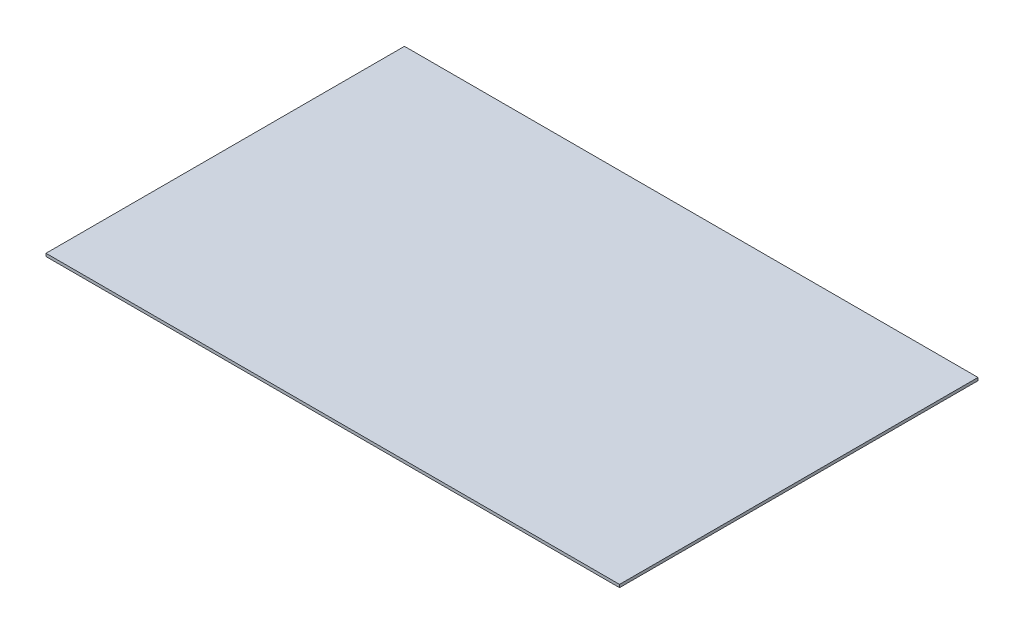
ISO-10303-21;
HEADER;
FILE_DESCRIPTION(('STEP AP214'),'2;1');
FILE_NAME('part.step','',(''),(''),'','','');
FILE_SCHEMA(('AUTOMOTIVE_DESIGN { 1 0 10303 214 1 1 1 1 }'));
ENDSEC;
DATA;
#1=APPLICATION_CONTEXT('core data for automotive mechanical design processes');
#2=APPLICATION_PROTOCOL_DEFINITION('international standard','automotive_design',2000,#1);
#3=PRODUCT_CONTEXT('',#1,'mechanical');
#4=PRODUCT('Part','Part','',(#3));
#5=PRODUCT_RELATED_PRODUCT_CATEGORY('part','',(#4));
#6=PRODUCT_DEFINITION_FORMATION('','',#4);
#7=PRODUCT_DEFINITION_CONTEXT('part definition',#1,'design');
#8=PRODUCT_DEFINITION('design','',#6,#7);
#9=PRODUCT_DEFINITION_SHAPE('','',#8);
#10=(LENGTH_UNIT() NAMED_UNIT(*) SI_UNIT(.MILLI.,.METRE.));
#11=(NAMED_UNIT(*) PLANE_ANGLE_UNIT() SI_UNIT($,.RADIAN.));
#12=(NAMED_UNIT(*) SI_UNIT($,.STERADIAN.) SOLID_ANGLE_UNIT());
#13=UNCERTAINTY_MEASURE_WITH_UNIT(LENGTH_MEASURE(1.E-05),#10,'distance_accuracy_value','');
#14=(GEOMETRIC_REPRESENTATION_CONTEXT(3) GLOBAL_UNCERTAINTY_ASSIGNED_CONTEXT((#13)) GLOBAL_UNIT_ASSIGNED_CONTEXT((#10,
#11,#12)) REPRESENTATION_CONTEXT('',''));
#15=CARTESIAN_POINT('',(0.,0.,0.));
#16=DIRECTION('',(0.,0.,1.));
#17=DIRECTION('',(1.,0.,0.));
#18=AXIS2_PLACEMENT_3D('',#15,#16,#17);
#19=CARTESIAN_POINT('',(-25.4,2.54,0.));
#20=DIRECTION('',(-1.,0.,0.));
#21=DIRECTION('',(0.,0.,1.));
#22=AXIS2_PLACEMENT_3D('',#19,#20,#21);
#23=PLANE('',#22);
#24=DIRECTION('',(0.,1.,0.));
#25=VECTOR('',#24,1.);
#26=CARTESIAN_POINT('',(-25.4,2.54,-57.15));
#27=LINE('',#26,#25);
#28=CARTESIAN_POINT('',(-25.4,2.413,-57.15));
#29=VERTEX_POINT('',#28);
#30=CARTESIAN_POINT('',(-25.4,2.667,-57.15));
#31=VERTEX_POINT('',#30);
#32=EDGE_CURVE('E11',#29,#31,#27,.T.);
#33=ORIENTED_EDGE('',*,*,#32,.F.);
#34=DIRECTION('',(0.,0.,1.));
#35=VECTOR('',#34,1.);
#36=CARTESIAN_POINT('',(-25.4,2.413,0.));
#37=LINE('',#36,#35);
#38=CARTESIAN_POINT('',(-25.4,2.413,-25.4));
#39=VERTEX_POINT('',#38);
#40=EDGE_CURVE('E94',#29,#39,#37,.T.);
#41=ORIENTED_EDGE('',*,*,#40,.T.);
#42=DIRECTION('',(0.,1.,0.));
#43=VECTOR('',#42,1.);
#44=CARTESIAN_POINT('',(-25.4,2.54,-25.4));
#45=LINE('',#44,#43);
#46=CARTESIAN_POINT('',(-25.4,2.667,-25.4));
#47=VERTEX_POINT('',#46);
#48=EDGE_CURVE('E49',#39,#47,#45,.T.);
#49=ORIENTED_EDGE('',*,*,#48,.T.);
#50=DIRECTION('',(0.,0.,1.));
#51=VECTOR('',#50,1.);
#52=CARTESIAN_POINT('',(-25.4,2.667,0.));
#53=LINE('',#52,#51);
#54=EDGE_CURVE('E107',#31,#47,#53,.T.);
#55=ORIENTED_EDGE('',*,*,#54,.F.);
#56=EDGE_LOOP('',(#33,#41,#49,#55));
#57=FACE_BOUND('',#56,.T.);
#58=ADVANCED_FACE('F39',(#57),#23,.T.);
#59=CARTESIAN_POINT('',(0.,2.54,-25.4));
#60=DIRECTION('',(0.,0.,1.));
#61=DIRECTION('',(1.,0.,0.));
#62=AXIS2_PLACEMENT_3D('',#59,#60,#61);
#63=PLANE('',#62);
#64=ORIENTED_EDGE('',*,*,#48,.F.);
#65=DIRECTION('',(1.,0.,0.));
#66=VECTOR('',#65,1.);
#67=CARTESIAN_POINT('',(0.,2.413,-25.4));
#68=LINE('',#67,#66);
#69=CARTESIAN_POINT('',(25.4,2.413,-25.4));
#70=VERTEX_POINT('',#69);
#71=EDGE_CURVE('E101',#39,#70,#68,.T.);
#72=ORIENTED_EDGE('',*,*,#71,.T.);
#73=DIRECTION('',(0.,1.,0.));
#74=VECTOR('',#73,1.);
#75=CARTESIAN_POINT('',(25.4,2.54,-25.4));
#76=LINE('',#75,#74);
#77=CARTESIAN_POINT('',(25.4,2.667,-25.4));
#78=VERTEX_POINT('',#77);
#79=EDGE_CURVE('E57',#70,#78,#76,.T.);
#80=ORIENTED_EDGE('',*,*,#79,.T.);
#81=DIRECTION('',(1.,0.,0.));
#82=VECTOR('',#81,1.);
#83=CARTESIAN_POINT('',(0.,2.667,-25.4));
#84=LINE('',#83,#82);
#85=EDGE_CURVE('E88',#47,#78,#84,.T.);
#86=ORIENTED_EDGE('',*,*,#85,.F.);
#87=EDGE_LOOP('',(#64,#72,#80,#86));
#88=FACE_BOUND('',#87,.T.);
#89=ADVANCED_FACE('F111',(#88),#63,.T.);
#90=CARTESIAN_POINT('',(25.4,2.54,0.));
#91=DIRECTION('',(-1.,0.,0.));
#92=DIRECTION('',(0.,0.,1.));
#93=AXIS2_PLACEMENT_3D('',#90,#91,#92);
#94=PLANE('',#93);
#95=ORIENTED_EDGE('',*,*,#79,.F.);
#96=DIRECTION('',(0.,0.,1.));
#97=VECTOR('',#96,1.);
#98=CARTESIAN_POINT('',(25.4,2.413,0.));
#99=LINE('',#98,#97);
#100=CARTESIAN_POINT('',(25.4,2.413,-57.15));
#101=VERTEX_POINT('',#100);
#102=EDGE_CURVE('E93',#70,#101,#99,.F.);
#103=ORIENTED_EDGE('',*,*,#102,.T.);
#104=DIRECTION('',(0.,1.,0.));
#105=VECTOR('',#104,1.);
#106=CARTESIAN_POINT('',(25.4,2.54,-57.15));
#107=LINE('',#106,#105);
#108=CARTESIAN_POINT('',(25.4,2.667,-57.15));
#109=VERTEX_POINT('',#108);
#110=EDGE_CURVE('E43',#101,#109,#107,.T.);
#111=ORIENTED_EDGE('',*,*,#110,.T.);
#112=DIRECTION('',(0.,0.,1.));
#113=VECTOR('',#112,1.);
#114=CARTESIAN_POINT('',(25.4,2.667,0.));
#115=LINE('',#114,#113);
#116=EDGE_CURVE('E103',#78,#109,#115,.F.);
#117=ORIENTED_EDGE('',*,*,#116,.F.);
#118=EDGE_LOOP('',(#95,#103,#111,#117));
#119=FACE_BOUND('',#118,.T.);
#120=ADVANCED_FACE('F96',(#119),#94,.F.);
#121=CARTESIAN_POINT('',(0.,2.54,-57.15));
#122=DIRECTION('',(0.,0.,1.));
#123=DIRECTION('',(1.,0.,0.));
#124=AXIS2_PLACEMENT_3D('',#121,#122,#123);
#125=PLANE('',#124);
#126=DIRECTION('',(1.,0.,0.));
#127=VECTOR('',#126,1.);
#128=CARTESIAN_POINT('',(0.,2.413,-57.15));
#129=LINE('',#128,#127);
#130=EDGE_CURVE('E82',#101,#29,#129,.F.);
#131=ORIENTED_EDGE('',*,*,#130,.T.);
#132=ORIENTED_EDGE('',*,*,#32,.T.);
#133=DIRECTION('',(1.,0.,0.));
#134=VECTOR('',#133,1.);
#135=CARTESIAN_POINT('',(0.,2.667,-57.15));
#136=LINE('',#135,#134);
#137=EDGE_CURVE('E84',#109,#31,#136,.F.);
#138=ORIENTED_EDGE('',*,*,#137,.F.);
#139=ORIENTED_EDGE('',*,*,#110,.F.);
#140=EDGE_LOOP('',(#131,#132,#138,#139));
#141=FACE_BOUND('',#140,.T.);
#142=ADVANCED_FACE('F41',(#141),#125,.F.);
#143=CARTESIAN_POINT('',(0.,2.667,0.));
#144=DIRECTION('',(0.,1.,0.));
#145=DIRECTION('',(0.,0.,1.));
#146=AXIS2_PLACEMENT_3D('',#143,#144,#145);
#147=PLANE('',#146);
#148=ORIENTED_EDGE('',*,*,#116,.T.);
#149=ORIENTED_EDGE('',*,*,#137,.T.);
#150=ORIENTED_EDGE('',*,*,#54,.T.);
#151=ORIENTED_EDGE('',*,*,#85,.T.);
#152=EDGE_LOOP('',(#148,#149,#150,#151));
#153=FACE_BOUND('',#152,.T.);
#154=ADVANCED_FACE('F110',(#153),#147,.T.);
#155=CARTESIAN_POINT('',(0.,2.413,0.));
#156=DIRECTION('',(0.,1.,0.));
#157=DIRECTION('',(0.,0.,1.));
#158=AXIS2_PLACEMENT_3D('',#155,#156,#157);
#159=PLANE('',#158);
#160=ORIENTED_EDGE('',*,*,#102,.F.);
#161=ORIENTED_EDGE('',*,*,#71,.F.);
#162=ORIENTED_EDGE('',*,*,#40,.F.);
#163=ORIENTED_EDGE('',*,*,#130,.F.);
#164=EDGE_LOOP('',(#160,#161,#162,#163));
#165=FACE_BOUND('',#164,.T.);
#166=ADVANCED_FACE('F91',(#165),#159,.F.);
#167=CLOSED_SHELL('',(#58,#89,#120,#142,#154,#166));
#168=MANIFOLD_SOLID_BREP('B2',#167);
#169=ADVANCED_BREP_SHAPE_REPRESENTATION('',(#18,#168),#14);
#170=SHAPE_DEFINITION_REPRESENTATION(#9,#169);
ENDSEC;
END-ISO-10303-21;
